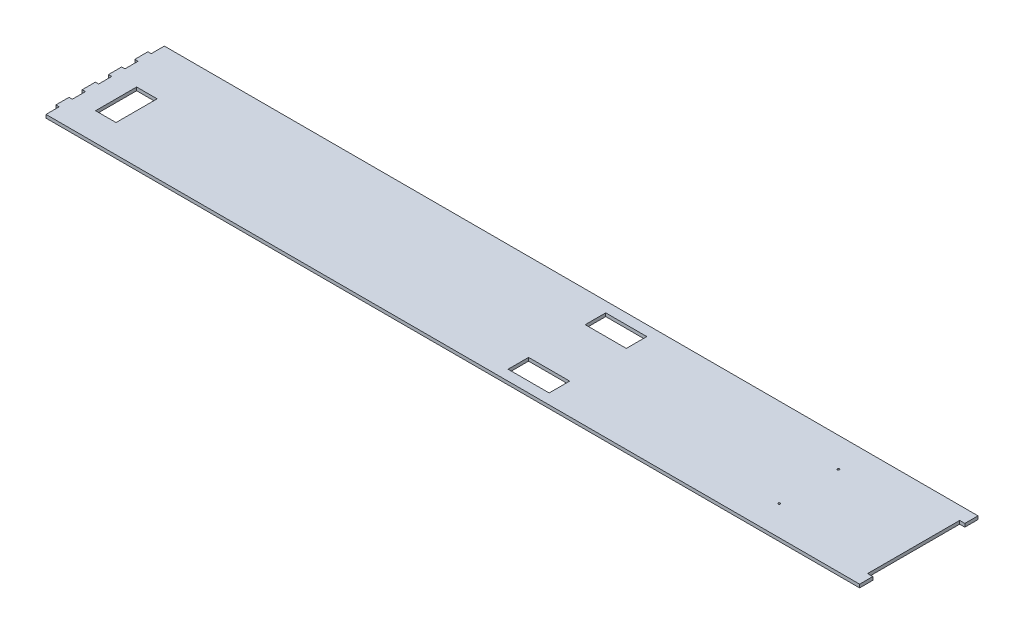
from build123d import *

# Parameters (mm, degrees)
SKETCH1_W                = 3.175
SKETCH1_H                = 12.7
BOSS_EXTRUDE1_DEPTH      = 3.175
CUT_EXTRUDE2_DEPTH       = 475.94911915
CUT_EXTRUDE2_DEPTH_BACK  = 475.94911915
CUT_EXTRUDE3_DEPTH       = 475.94911915
CUT_EXTRUDE3_DEPTH_BACK  = 475.94911915
SKETCH3_W                = 4.9365
SKETCH3_H                = 12.7
CUT_EXTRUDE4_DEPTH       = 475.94911915
CUT_EXTRUDE9_DEPTH       = 475.94911915
CUT_EXTRUDE9_DEPTH_BACK  = 475.94911915
SKETCH7_W                = 4.9365
SKETCH7_H                = 12.7
SKETCH8_W                = 5
SKETCH8_H                = 12.7
BOSS_EXTRUDE2_DEPTH      = 3.175
CUT_EXTRUDE10_DEPTH      = 475.94911915
CUT_EXTRUDE10_DEPTH_BACK = 475.94911915
SKETCH9_R                = 1
CUT_EXTRUDE11_DEPTH      = 475.94911915
CUT_EXTRUDE11_DEPTH_BACK = 475.94911915
SKETCH10_R               = 1
SKETCH12_W               = 118.655378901
SKETCH12_H               = 114.3
BOSS_EXTRUDE3_DEPTH      = 3.175
CUT_EXTRUDE12_DEPTH      = 475.94911915
CUT_EXTRUDE12_DEPTH_BACK = 475.94911915
BOSS_EXTRUDE4_DEPTH      = 3.175
CUT_EXTRUDE13_DEPTH      = 475.94911915
CUT_EXTRUDE13_DEPTH_BACK = 475.94911915
SKETCH15_W               = 19.812
SKETCH15_H               = 39.6875
SKETCH15_R               = 1
SKETCH15_W_2             = 39.6875
SKETCH15_H_2             = 19.812


with BuildPart() as part:
    # Sketch1 → Boss-Extrude1 (new body)
    with BuildSketch(Plane(origin=(0, 0, 0), x_dir=(1, 0, 0), z_dir=(0, 1, 0))):
        Polygon((-468.3125, 57.15), (-468.3125, 44.45), (-468.3125, 31.75), (-468.3125, 19.05), (-468.3125, 6.35), (-468.3125, -6.35), (-468.3125, -19.05), (-468.3125, -31.75), (-468.3125, -44.45), (-468.3125, -57.15), (471.4875, -57.15), (471.4875, 57.15), align=None)
        with Locations((-469.9, 38.1)):
            Rectangle(SKETCH1_W, SKETCH1_H)
        with Locations((-469.9, 12.7)):
            Rectangle(SKETCH1_W, SKETCH1_H)
        with Locations((-469.9, -12.7)):
            Rectangle(SKETCH1_W, SKETCH1_H)
        with Locations((-469.9, -38.1)):
            Rectangle(SKETCH1_W, SKETCH1_H)
    extrude(amount=BOSS_EXTRUDE1_DEPTH)

    # Sketch2 → Cut-Extrude2 (cut, two sides: drawn at the far end of the back side and taken through both)
    with BuildSketch(Plane(origin=(0, 3.175, 0), x_dir=(1, 0, 0), z_dir=(0, 1, 0)).offset(-CUT_EXTRUDE2_DEPTH_BACK)):
        Polygon((211.101966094, 0), (162.4875, -48.614466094), (113.873033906, 0), (162.4875, 48.614466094), align=None)
        Polygon((9.573033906, 0), (58.1875, 48.614466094), (106.801966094, 0), (58.1875, -48.614466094), align=None)
        Polygon((-46.1125, 48.614466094), (2.501966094, 0), (-46.1125, -48.614466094), (-94.726966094, 0), align=None)
        Polygon((61.723033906, -52.15), (158.951966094, -52.15), (110.3375, -3.535533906), align=None)
        Polygon((110.3375, 3.535533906), (158.951966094, 52.15), (61.723033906, 52.15), align=None)
        Polygon((371.0875, 48.614466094), (419.701966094, 0), (371.0875, -48.614466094), (322.473033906, 0), align=None)
    extrude(amount=CUT_EXTRUDE2_DEPTH + CUT_EXTRUDE2_DEPTH_BACK, mode=Mode.SUBTRACT)

    # Sketch2_6 → Cut-Extrude3 (cut, two sides: drawn at the far end of the back side and taken through both)
    with BuildSketch(Plane(origin=(0, 3.175, 0), x_dir=(1, 0, 0), z_dir=(0, 1, 0)).offset(-CUT_EXTRUDE3_DEPTH_BACK)):
        Polygon((6.0375, 3.535533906), (54.651966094, 52.15), (-42.576966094, 52.15), align=None)
        Polygon((-42.576966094, -52.15), (54.651966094, -52.15), (6.0375, -3.535533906), align=None)
        Polygon((-146.876966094, -52.15), (-49.648033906, -52.15), (-98.2625, -3.535533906), align=None)
        Polygon((-98.2625, 3.535533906), (-49.648033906, 52.15), (-146.876966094, 52.15), align=None)
        Polygon((-101.798033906, 0), (-150.4125, -48.614466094), (-199.026966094, 0), (-150.4125, 48.614466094), align=None)
        Polygon((-202.5625, 3.535533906), (-153.948033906, 52.15), (-251.176966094, 52.15), align=None)
        Polygon((-206.098033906, 0), (-254.7125, -48.614466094), (-303.326966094, 0), (-254.7125, 48.614466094), align=None)
        Polygon((-306.8625, 3.535533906), (-258.248033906, 52.15), (-355.476966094, 52.15), align=None)
        Polygon((-407.626966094, 0), (-359.0125, 48.614466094), (-310.398033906, 0), (-359.0125, -48.614466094), align=None)
        Polygon((-355.476966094, -52.15), (-258.248033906, -52.15), (-306.8625, -3.535533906), align=None)
        Polygon((-251.176966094, -52.15), (-153.948033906, -52.15), (-202.5625, -3.535533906), align=None)
        Polygon((371.0875, -48.614466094), (322.473033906, 0), (371.0875, 48.614466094), (419.701966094, 0), align=None)
    extrude(amount=CUT_EXTRUDE3_DEPTH + CUT_EXTRUDE3_DEPTH_BACK, mode=Mode.SUBTRACT)

    # Sketch3 → Cut-Extrude4 (cut, through all)
    with BuildSketch(Plane(origin=(0, 3.175, 0), x_dir=(1, 0, 0), z_dir=(0, 1, 0))):
        with Locations((434.55525, -38.1)):
            Rectangle(SKETCH3_W, SKETCH3_H)
        with Locations((434.55525, -12.7)):
            Rectangle(SKETCH3_W, SKETCH3_H)
        with Locations((434.55525, 12.7)):
            Rectangle(SKETCH3_W, SKETCH3_H)
        with Locations((434.55525, 38.1)):
            Rectangle(SKETCH3_W, SKETCH3_H)
    extrude(amount=-CUT_EXTRUDE4_DEPTH, mode=Mode.SUBTRACT)

    # Sketch7 → Cut-Extrude9 (cut, two sides: drawn at the far end of the back side and taken through both)
    with BuildSketch(Plane(origin=(0, 3.175, 0), x_dir=(1, 0, 0), z_dir=(0, 1, 0)).offset(-CUT_EXTRUDE9_DEPTH_BACK)):
        with Locations((434.55525, -25.4)):
            Rectangle(SKETCH7_W, SKETCH7_H)
        with Locations((434.55525, 0)):
            Rectangle(SKETCH7_W, SKETCH7_H)
        with Locations((434.55525, 25.4)):
            Rectangle(SKETCH7_W, SKETCH7_H)
        Polygon((437.0235, 44.45), (437.0235, 31.75), (437.0235, 19.05), (437.0235, 6.35), (437.0235, -6.35), (437.0235, -19.05), (437.0235, -31.75), (437.0235, -44.45), (437.0235, -57.15), (471.4875, -57.15), (471.4875, 57.15), (437.0235, 57.15), align=None)
        with Locations((434.55525, -50.8)):
            Rectangle(SKETCH7_W, SKETCH7_H)
        with Locations((434.55525, 50.8)):
            Rectangle(SKETCH7_W, SKETCH7_H)
    extrude(amount=CUT_EXTRUDE9_DEPTH + CUT_EXTRUDE9_DEPTH_BACK, mode=Mode.SUBTRACT)

    # Sketch8 → Boss-Extrude2 (add)
    with BuildSketch(Plane(origin=(0, 3.175, 0), x_dir=(1, 0, 0), z_dir=(0, 1, 0))):
        with Locations((434.587, -50.8)):
            Rectangle(SKETCH8_W, SKETCH8_H)
        with Locations((434.587, 50.8)):
            Rectangle(SKETCH8_W, SKETCH8_H)
    extrude(amount=-BOSS_EXTRUDE2_DEPTH)

    # Sketch9 → Cut-Extrude10 (cut, two sides: drawn at the far end of the back side and taken through both)
    with BuildSketch(Plane(origin=(0, 3.175, 0), x_dir=(1, 0, 0), z_dir=(0, 1, 0)).offset(-CUT_EXTRUDE10_DEPTH_BACK)):
        with Locations(Location((-437.969733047, 0, 0), (0, 0, 270))):
            Circle(SKETCH9_R)
    extrude(amount=CUT_EXTRUDE10_DEPTH + CUT_EXTRUDE10_DEPTH_BACK, mode=Mode.SUBTRACT)

    # Sketch10 → Cut-Extrude11 (cut, two sides: drawn at the far end of the back side and taken through both)
    with BuildSketch(Plane(origin=(0, 3.175, 0), x_dir=(1, 0, 0), z_dir=(0, 1, 0)).offset(-CUT_EXTRUDE11_DEPTH_BACK)):
        with Locations(Location((211.101966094, 28.575, 0), (0, 0, 270))):
            Circle(SKETCH10_R)
        with Locations(Location((211.101966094, -28.575, 0), (0, 0, 270))):
            Circle(SKETCH10_R)
    extrude(amount=CUT_EXTRUDE11_DEPTH + CUT_EXTRUDE11_DEPTH_BACK, mode=Mode.SUBTRACT)

    # Sketch12 → Boss-Extrude3 (add)
    with BuildSketch(Plane(origin=(0, 3.175, 0), x_dir=(1, 0, 0), z_dir=(0, 1, 0))):
        with Locations((362.774895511, 0)):
            Rectangle(SKETCH12_W, SKETCH12_H)
    extrude(amount=-BOSS_EXTRUDE3_DEPTH)

    # Sketch13 → Cut-Extrude12 (cut, two sides: drawn at the far end of the back side and taken through both)
    with BuildSketch(Plane(origin=(0, 3.175, 0), x_dir=(1, 0, 0), z_dir=(0, 1, 0)).offset(-CUT_EXTRUDE12_DEPTH_BACK)):
        Polygon((437.087, 57.15), (317.36377, 57.15), (317.36377, 44.45), (312.36377, 44.45), (312.36377, 0), (432.087, 0), (432.087, 44.45), (437.087, 44.45), align=None)
        Polygon((432.087, 0), (312.36377, 0), (312.36377, -44.45), (317.36377, -44.45), (317.36377, -57.15), (437.087, -57.15), (437.087, -44.45), (432.087, -44.45), align=None)
    extrude(amount=CUT_EXTRUDE12_DEPTH + CUT_EXTRUDE12_DEPTH_BACK, mode=Mode.SUBTRACT)

    # Sketch14 → Boss-Extrude4 (add)
    with BuildSketch(Plane(origin=(0, 3.175, 0), x_dir=(1, 0, 0), z_dir=(0, 1, 0))):
        Polygon((206.092718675, 15.731366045), (159.786492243, 57.15), (-416.84736541, 57.15), (-416.84736541, -57.15), (196.308319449, -57.15), (196.308319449, -25.185212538), (215.877117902, -13.325334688), (220.502987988, 5.533981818), align=None)
    extrude(amount=-BOSS_EXTRUDE4_DEPTH)

    # Sketch15 → Cut-Extrude13 (cut, two sides: drawn at the far end of the back side and taken through both)
    # profile 1 of 3: a face of its own
    with BuildSketch(Plane(origin=(0, 3.175, 0), x_dir=(1, 0, 0), z_dir=(0, 1, 0)).offset(-CUT_EXTRUDE13_DEPTH_BACK)):
        with Locations((-437.588733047, -10.31875)):
            Rectangle(SKETCH15_W, SKETCH15_H)
        with Locations((-437.969733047, 0)):
            Circle(SKETCH15_R, mode=Mode.SUBTRACT)
    # profile 2 of 3: a face of its own
    with BuildSketch(Plane(origin=(0, 3.175, 0), x_dir=(1, 0, 0), z_dir=(0, 1, 0)).offset(-CUT_EXTRUDE13_DEPTH_BACK)):
        with Locations((-12.27998, -37.244)):
            Rectangle(SKETCH15_W_2, SKETCH15_H_2)
    # profile 3 of 3: a face of its own
    with BuildSketch(Plane(origin=(0, 3.175, 0), x_dir=(1, 0, 0), z_dir=(0, 1, 0)).offset(-CUT_EXTRUDE13_DEPTH_BACK)):
        with Locations((-12.27998, 37.244)):
            Rectangle(SKETCH15_W_2, SKETCH15_H_2)
    extrude(amount=CUT_EXTRUDE13_DEPTH + CUT_EXTRUDE13_DEPTH_BACK, mode=Mode.SUBTRACT)


solid = part.part
